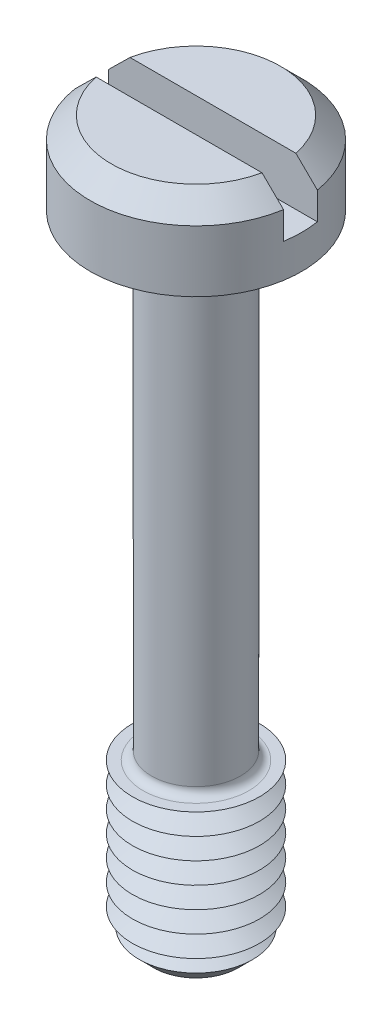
ISO-10303-21;
HEADER;
FILE_DESCRIPTION(('STEP AP214'),'2;1');
FILE_NAME('part.step','',(''),(''),'','','');
FILE_SCHEMA(('AUTOMOTIVE_DESIGN { 1 0 10303 214 1 1 1 1 }'));
ENDSEC;
DATA;
#1=APPLICATION_CONTEXT('core data for automotive mechanical design processes');
#2=APPLICATION_PROTOCOL_DEFINITION('international standard','automotive_design',2000,#1);
#3=PRODUCT_CONTEXT('',#1,'mechanical');
#4=PRODUCT('Part','Part','',(#3));
#5=PRODUCT_RELATED_PRODUCT_CATEGORY('part','',(#4));
#6=PRODUCT_DEFINITION_FORMATION('','',#4);
#7=PRODUCT_DEFINITION_CONTEXT('part definition',#1,'design');
#8=PRODUCT_DEFINITION('design','',#6,#7);
#9=PRODUCT_DEFINITION_SHAPE('','',#8);
#10=(LENGTH_UNIT() NAMED_UNIT(*) SI_UNIT(.MILLI.,.METRE.));
#11=(NAMED_UNIT(*) PLANE_ANGLE_UNIT() SI_UNIT($,.RADIAN.));
#12=(NAMED_UNIT(*) SI_UNIT($,.STERADIAN.) SOLID_ANGLE_UNIT());
#13=UNCERTAINTY_MEASURE_WITH_UNIT(LENGTH_MEASURE(1.E-05),#10,'distance_accuracy_value','');
#14=(GEOMETRIC_REPRESENTATION_CONTEXT(3) GLOBAL_UNCERTAINTY_ASSIGNED_CONTEXT((#13)) GLOBAL_UNIT_ASSIGNED_CONTEXT((#10,
#11,#12)) REPRESENTATION_CONTEXT('',''));
#15=CARTESIAN_POINT('',(0.,0.,0.));
#16=DIRECTION('',(0.,0.,1.));
#17=DIRECTION('',(1.,0.,0.));
#18=AXIS2_PLACEMENT_3D('',#15,#16,#17);
#19=CARTESIAN_POINT('',(0.,3.9,0.));
#20=DIRECTION('',(0.,1.,0.));
#21=DIRECTION('',(0.,0.,1.));
#22=AXIS2_PLACEMENT_3D('',#19,#20,#21);
#23=PLANE('',#22);
#24=DIRECTION('',(-1.,0.,0.));
#25=VECTOR('',#24,1.);
#26=CARTESIAN_POINT('',(5.,3.9,-0.8));
#27=LINE('',#26,#25);
#28=CARTESIAN_POINT('',(3.91918358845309,3.9,-0.8));
#29=VERTEX_POINT('',#28);
#30=CARTESIAN_POINT('',(-3.91918358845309,3.9,-0.8));
#31=VERTEX_POINT('',#30);
#32=EDGE_CURVE('E110',#29,#31,#27,.T.);
#33=ORIENTED_EDGE('',*,*,#32,.F.);
#34=CARTESIAN_POINT('',(0.,3.9,0.));
#35=DIRECTION('',(0.,1.,0.));
#36=DIRECTION('',(0.,0.,1.));
#37=AXIS2_PLACEMENT_3D('',#34,#35,#36);
#38=CIRCLE('',#37,4.);
#39=EDGE_CURVE('E113',#29,#31,#38,.T.);
#40=ORIENTED_EDGE('',*,*,#39,.T.);
#41=EDGE_LOOP('',(#33,#40));
#42=FACE_BOUND('',#41,.T.);
#43=ADVANCED_FACE('F39',(#42),#23,.T.);
#44=CARTESIAN_POINT('',(0.,3.9,0.));
#45=DIRECTION('',(0.,-1.,0.));
#46=DIRECTION('',(0.,0.,-1.));
#47=AXIS2_PLACEMENT_3D('',#44,#45,#46);
#48=CONICAL_SURFACE('',#47,4.,0.785398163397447);
#49=CARTESIAN_POINT('',(11.0010756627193,-3.13012537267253,-0.8));
#50=CARTESIAN_POINT('',(10.6180645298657,-2.74813121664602,-0.8));
#51=CARTESIAN_POINT('',(10.2350087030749,-2.36618183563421,-0.8));
#52=CARTESIAN_POINT('',(9.46873746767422,-1.60241986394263,-0.8));
#53=CARTESIAN_POINT('',(9.08552205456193,-1.2206072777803,-0.8));
#54=CARTESIAN_POINT('',(8.31861292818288,-0.456918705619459,-0.8));
#55=CARTESIAN_POINT('',(7.93491906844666,-0.0750428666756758,-0.8));
#56=CARTESIAN_POINT('',(7.16722555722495,0.688378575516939,-0.8));
#57=CARTESIAN_POINT('',(6.78322591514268,1.06992418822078,-0.8));
#58=CARTESIAN_POINT('',(6.01856215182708,1.82868912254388,-0.8));
#59=CARTESIAN_POINT('',(5.63790309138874,2.20591354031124,-0.8));
#60=CARTESIAN_POINT('',(5.06622054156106,2.77108317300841,-0.8));
#61=CARTESIAN_POINT('',(4.87553531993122,2.9593704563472,-0.8));
#62=CARTESIAN_POINT('',(4.49384424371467,3.33561647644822,-0.8));
#63=CARTESIAN_POINT('',(4.302838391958,3.52357521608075,-0.8));
#64=CARTESIAN_POINT('',(3.92044271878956,3.89893397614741,-0.8));
#65=CARTESIAN_POINT('',(3.72905310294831,4.08633420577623,-0.8));
#66=CARTESIAN_POINT('',(3.34554223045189,4.46039762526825,-0.8));
#67=CARTESIAN_POINT('',(3.15342094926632,4.64706078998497,-0.8));
#68=CARTESIAN_POINT('',(2.76802565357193,5.01913697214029,-0.8));
#69=CARTESIAN_POINT('',(2.57475182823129,5.20455018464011,-0.8));
#70=CARTESIAN_POINT('',(2.28318236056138,5.4809110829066,-0.8));
#71=CARTESIAN_POINT('',(2.1857187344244,5.57273577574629,-0.8));
#72=CARTESIAN_POINT('',(1.98998431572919,5.75552004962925,-0.8));
#73=CARTESIAN_POINT('',(1.89171354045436,5.84647964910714,-0.8));
#74=CARTESIAN_POINT('',(1.76578543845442,5.96147491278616,-0.8));
#75=CARTESIAN_POINT('',(1.73869031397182,5.98612635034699,-0.8));
#76=CARTESIAN_POINT('',(1.68439529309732,6.0353137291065,-0.8));
#77=CARTESIAN_POINT('',(1.65719539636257,6.05984966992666,-0.8));
#78=CARTESIAN_POINT('',(1.5754162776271,6.13326356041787,-0.8));
#79=CARTESIAN_POINT('',(1.52066027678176,6.18194515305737,-0.8));
#80=CARTESIAN_POINT('',(1.41038257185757,6.27874171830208,-0.8));
#81=CARTESIAN_POINT('',(1.35485918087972,6.32685477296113,-0.8));
#82=CARTESIAN_POINT('',(1.24299231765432,6.42210730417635,-0.8));
#83=CARTESIAN_POINT('',(1.18664895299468,6.46924690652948,-0.8));
#84=CARTESIAN_POINT('',(1.07845249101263,6.55754663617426,-0.8));
#85=CARTESIAN_POINT('',(1.02670624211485,6.59883713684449,-0.8));
#86=CARTESIAN_POINT('',(0.921961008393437,6.67979338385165,-0.8));
#87=CARTESIAN_POINT('',(0.868962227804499,6.7194593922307,-0.8));
#88=CARTESIAN_POINT('',(0.761295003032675,6.79630361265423,-0.8));
#89=CARTESIAN_POINT('',(0.706629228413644,6.83348552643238,-0.8));
#90=CARTESIAN_POINT('',(0.594896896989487,6.90399895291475,-0.8));
#91=CARTESIAN_POINT('',(0.5378333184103,6.93733506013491,-0.8));
#92=CARTESIAN_POINT('',(0.428390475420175,6.99356340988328,-0.8));
#93=CARTESIAN_POINT('',(0.376435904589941,7.0172602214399,-0.8));
#94=CARTESIAN_POINT('',(0.269759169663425,7.05717670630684,-0.8));
#95=CARTESIAN_POINT('',(0.215046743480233,7.07342088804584,-0.8));
#96=CARTESIAN_POINT('',(0.113016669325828,7.093321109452,-0.8));
#97=CARTESIAN_POINT('',(0.0660435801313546,7.09866042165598,-0.8));
#98=CARTESIAN_POINT('',(-0.0280587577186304,7.10088875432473,-0.8));
#99=CARTESIAN_POINT('',(-0.0751877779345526,7.09778705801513,-0.8));
#100=CARTESIAN_POINT('',(-0.180723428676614,7.08192474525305,-0.8));
#101=CARTESIAN_POINT('',(-0.238762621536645,7.066795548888,-0.8));
#102=CARTESIAN_POINT('',(-0.323499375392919,7.03748409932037,-0.8));
#103=CARTESIAN_POINT('',(-0.351441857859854,7.0265659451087,-0.8));
#104=CARTESIAN_POINT('',(-0.40656991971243,7.00295901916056,-0.8));
#105=CARTESIAN_POINT('',(-0.433755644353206,6.99027059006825,-0.8));
#106=CARTESIAN_POINT('',(-0.504673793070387,6.95489235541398,-0.8));
#107=CARTESIAN_POINT('',(-0.547808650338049,6.93101671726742,-0.8));
#108=CARTESIAN_POINT('',(-0.632566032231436,6.88069648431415,-0.8));
#109=CARTESIAN_POINT('',(-0.674187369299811,6.85424992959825,-0.8));
#110=CARTESIAN_POINT('',(-0.756326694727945,6.79950439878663,-0.8));
#111=CARTESIAN_POINT('',(-0.796841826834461,6.77120117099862,-0.8));
#112=CARTESIAN_POINT('',(-0.876938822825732,6.71329852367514,-0.8));
#113=CARTESIAN_POINT('',(-0.916520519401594,6.68369887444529,-0.8));
#114=CARTESIAN_POINT('',(-1.03465904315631,6.59312324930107,-0.8));
#115=CARTESIAN_POINT('',(-1.11211338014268,6.5307142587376,-0.8));
#116=CARTESIAN_POINT('',(-1.26505454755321,6.40381418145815,-0.8));
#117=CARTESIAN_POINT('',(-1.34054439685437,6.33932667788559,-0.8));
#118=CARTESIAN_POINT('',(-1.48913173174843,6.2099708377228,-0.8));
#119=CARTESIAN_POINT('',(-1.5622481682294,6.14512422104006,-0.8));
#120=CARTESIAN_POINT('',(-1.70765393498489,6.01451044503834,-0.8));
#121=CARTESIAN_POINT('',(-1.77994324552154,5.94874326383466,-0.8));
#122=CARTESIAN_POINT('',(-1.99594639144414,5.75046596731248,-0.8));
#123=CARTESIAN_POINT('',(-2.13877767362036,5.61699583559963,-0.8));
#124=CARTESIAN_POINT('',(-2.42324632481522,5.34853800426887,-0.8));
#125=CARTESIAN_POINT('',(-2.56488247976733,5.21354902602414,-0.8));
#126=CARTESIAN_POINT('',(-2.84730929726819,4.94270932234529,-0.8));
#127=CARTESIAN_POINT('',(-2.98810001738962,4.80685865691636,-0.8));
#128=CARTESIAN_POINT('',(-3.26818763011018,4.53549974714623,-0.8));
#129=CARTESIAN_POINT('',(-3.40748821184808,4.39999530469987,-0.8));
#130=CARTESIAN_POINT('',(-3.68570899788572,4.12859172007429,-0.8));
#131=CARTESIAN_POINT('',(-3.82462919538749,3.99269257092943,-0.8));
#132=CARTESIAN_POINT('',(-4.24087543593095,3.58468153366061,-0.8));
#133=CARTESIAN_POINT('',(-4.51779300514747,3.31215310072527,-0.8));
#134=CARTESIAN_POINT('',(-5.05279381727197,2.78443938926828,-0.8));
#135=CARTESIAN_POINT('',(-5.31091639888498,2.52929393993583,-0.8));
#136=CARTESIAN_POINT('',(-5.82680751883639,2.01864429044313,-0.8));
#137=CARTESIAN_POINT('',(-6.08457605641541,1.76314008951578,-0.8));
#138=CARTESIAN_POINT('',(-6.85760508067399,0.99619419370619,-0.8));
#139=CARTESIAN_POINT('',(-7.37251152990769,0.484395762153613,-0.8));
#140=CARTESIAN_POINT('',(-8.40657233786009,-0.544392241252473,-0.8));
#141=CARTESIAN_POINT('',(-8.92572224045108,-1.06138628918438,-0.8));
#142=CARTESIAN_POINT('',(-9.9636287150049,-2.09560660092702,-0.8));
#143=CARTESIAN_POINT('',(-10.4823853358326,-2.61283281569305,-0.8));
#144=CARTESIAN_POINT('',(-11.0010756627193,-3.13012537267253,-0.8));
#145=B_SPLINE_CURVE_WITH_KNOTS('',3,(#49,#50,#51,#52,#53,#54,#55,#56,#57,#58,#59,#60,#61,#62,
#63,#64,#65,#66,#67,#68,#69,#70,#71,#72,#73,#74,#75,#76,#77,#78,#79,#80,#81,#82,#83,#84,#85,#86,
#87,#88,#89,#90,#91,#92,#93,#94,#95,#96,#97,#98,#99,#100,#101,#102,#103,#104,#105,#106,#107,
#108,#109,#110,#111,#112,#113,#114,#115,#116,#117,#118,#119,#120,#121,#122,#123,#124,#125,#126,
#127,#128,#129,#130,#131,#132,#133,#134,#135,#136,#137,#138,#139,#140,#141,#142,#143,#144),
.UNSPECIFIED.,.F.,.F.,(4,2,2,2,2,2,2,2,2,2,2,2,2,2,2,2,2,2,2,2,2,2,2,2,2,2,2,2,2,2,2,2,2,2,2,2,
2,2,2,2,2,2,2,2,2,2,2,4),(0.,1.62282275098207,3.24569489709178,4.86971791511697,
6.49369278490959,8.10142191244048,8.90535980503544,9.7092906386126,10.5128682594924,
11.3164730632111,12.1199494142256,12.5216659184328,12.9233738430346,13.0332669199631,
13.1431603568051,13.3629580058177,13.5833578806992,13.8037290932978,14.0023112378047,
14.2008612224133,14.3991084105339,14.5971162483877,14.7680800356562,14.9384774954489,
15.0795987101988,15.2205647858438,15.3993585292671,15.4893211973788,15.5792664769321,
15.727032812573,15.8749126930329,16.0231439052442,16.1714014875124,16.4697244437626,
16.767558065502,17.0607348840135,17.35391868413,17.9403574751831,18.5273336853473,
19.1142694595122,19.6972736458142,20.2802881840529,21.4458742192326,22.5346981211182,
23.6235243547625,25.8015035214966,27.9995014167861,30.1971550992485),.UNSPECIFIED.);
#146=CARTESIAN_POINT('',(4.93558507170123,2.9,-0.8));
#147=VERTEX_POINT('',#146);
#148=EDGE_CURVE('E252',#147,#29,#145,.T.);
#149=ORIENTED_EDGE('',*,*,#148,.F.);
#150=CARTESIAN_POINT('',(0.,2.9,0.));
#151=DIRECTION('',(0.,1.,0.));
#152=DIRECTION('',(0.,0.,1.));
#153=AXIS2_PLACEMENT_3D('',#150,#151,#152);
#154=CIRCLE('',#153,5.);
#155=CARTESIAN_POINT('',(-4.93558507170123,2.9,-0.8));
#156=VERTEX_POINT('',#155);
#157=EDGE_CURVE('E128',#156,#147,#154,.F.);
#158=ORIENTED_EDGE('',*,*,#157,.F.);
#159=EDGE_CURVE('E102',#31,#156,#145,.T.);
#160=ORIENTED_EDGE('',*,*,#159,.F.);
#161=ORIENTED_EDGE('',*,*,#39,.F.);
#162=EDGE_LOOP('',(#149,#158,#160,#161));
#163=FACE_BOUND('',#162,.T.);
#164=ADVANCED_FACE('F214',(#163),#48,.T.);
#165=CARTESIAN_POINT('',(0.,-30.,0.));
#166=DIRECTION('',(0.,1.,0.));
#167=DIRECTION('',(0.,0.,1.));
#168=AXIS2_PLACEMENT_3D('',#165,#166,#167);
#169=CYLINDRICAL_SURFACE('',#168,2.1);
#170=CARTESIAN_POINT('',(0.,-22.1,0.));
#171=DIRECTION('',(0.,-1.,0.));
#172=DIRECTION('',(0.,0.,-1.));
#173=AXIS2_PLACEMENT_3D('',#170,#171,#172);
#174=CIRCLE('',#173,2.1);
#175=CARTESIAN_POINT('',(0.,-22.1,-2.1));
#176=VERTEX_POINT('',#175);
#177=EDGE_CURVE('E123',#176,#176,#174,.F.);
#178=ORIENTED_EDGE('',*,*,#177,.T.);
#179=EDGE_LOOP('',(#178));
#180=FACE_BOUND('',#179,.T.);
#181=CARTESIAN_POINT('',(0.,-0.400000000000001,0.));
#182=DIRECTION('',(0.,1.,0.));
#183=DIRECTION('',(0.,0.,1.));
#184=AXIS2_PLACEMENT_3D('',#181,#182,#183);
#185=CIRCLE('',#184,2.1);
#186=CARTESIAN_POINT('',(0.,-0.400000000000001,2.1));
#187=VERTEX_POINT('',#186);
#188=EDGE_CURVE('E349',#187,#187,#185,.F.);
#189=ORIENTED_EDGE('',*,*,#188,.T.);
#190=EDGE_LOOP('',(#189));
#191=FACE_BOUND('',#190,.T.);
#192=ADVANCED_FACE('F210',(#180,#191),#169,.T.);
#193=CARTESIAN_POINT('',(0.,3.9,0.));
#194=DIRECTION('',(0.,-1.,0.));
#195=DIRECTION('',(0.,0.,-1.));
#196=AXIS2_PLACEMENT_3D('',#193,#194,#195);
#197=CYLINDRICAL_SURFACE('',#196,5.);
#198=ORIENTED_EDGE('',*,*,#157,.T.);
#199=DIRECTION('',(0.,-1.,0.));
#200=VECTOR('',#199,1.);
#201=CARTESIAN_POINT('',(4.93558507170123,3.9,-0.8));
#202=LINE('',#201,#200);
#203=CARTESIAN_POINT('',(4.93558507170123,1.6,-0.8));
#204=VERTEX_POINT('',#203);
#205=EDGE_CURVE('E64',#147,#204,#202,.T.);
#206=ORIENTED_EDGE('',*,*,#205,.T.);
#207=CARTESIAN_POINT('',(0.,1.6,0.));
#208=DIRECTION('',(0.,1.,0.));
#209=DIRECTION('',(0.,0.,1.));
#210=AXIS2_PLACEMENT_3D('',#207,#208,#209);
#211=CIRCLE('',#210,5.);
#212=CARTESIAN_POINT('',(4.93558507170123,1.6,0.8));
#213=VERTEX_POINT('',#212);
#214=EDGE_CURVE('E11',#213,#204,#211,.T.);
#215=ORIENTED_EDGE('',*,*,#214,.F.);
#216=DIRECTION('',(0.,-1.,0.));
#217=VECTOR('',#216,1.);
#218=CARTESIAN_POINT('',(4.93558507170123,3.9,0.8));
#219=LINE('',#218,#217);
#220=CARTESIAN_POINT('',(4.93558507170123,2.9,0.8));
#221=VERTEX_POINT('',#220);
#222=EDGE_CURVE('E268',#213,#221,#219,.F.);
#223=ORIENTED_EDGE('',*,*,#222,.T.);
#224=CARTESIAN_POINT('',(-4.93558507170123,2.9,0.8));
#225=VERTEX_POINT('',#224);
#226=EDGE_CURVE('E120',#221,#225,#154,.F.);
#227=ORIENTED_EDGE('',*,*,#226,.T.);
#228=DIRECTION('',(0.,-1.,0.));
#229=VECTOR('',#228,1.);
#230=CARTESIAN_POINT('',(-4.93558507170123,3.9,0.8));
#231=LINE('',#230,#229);
#232=CARTESIAN_POINT('',(-4.93558507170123,1.6,0.8));
#233=VERTEX_POINT('',#232);
#234=EDGE_CURVE('E96',#225,#233,#231,.T.);
#235=ORIENTED_EDGE('',*,*,#234,.T.);
#236=CARTESIAN_POINT('',(-4.93558507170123,1.6,-0.8));
#237=VERTEX_POINT('',#236);
#238=EDGE_CURVE('E44',#237,#233,#211,.T.);
#239=ORIENTED_EDGE('',*,*,#238,.F.);
#240=DIRECTION('',(0.,-1.,0.));
#241=VECTOR('',#240,1.);
#242=CARTESIAN_POINT('',(-4.93558507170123,3.9,-0.8));
#243=LINE('',#242,#241);
#244=EDGE_CURVE('E272',#237,#156,#243,.F.);
#245=ORIENTED_EDGE('',*,*,#244,.T.);
#246=EDGE_LOOP('',(#198,#206,#215,#223,#227,#235,#239,#245));
#247=FACE_BOUND('',#246,.T.);
#248=CARTESIAN_POINT('',(0.,0.,0.));
#249=DIRECTION('',(0.,1.,0.));
#250=DIRECTION('',(0.,0.,1.));
#251=AXIS2_PLACEMENT_3D('',#248,#249,#250);
#252=CIRCLE('',#251,5.);
#253=CARTESIAN_POINT('',(0.,0.,5.));
#254=VERTEX_POINT('',#253);
#255=EDGE_CURVE('E334',#254,#254,#252,.T.);
#256=ORIENTED_EDGE('',*,*,#255,.T.);
#257=EDGE_LOOP('',(#256));
#258=FACE_BOUND('',#257,.T.);
#259=ADVANCED_FACE('F213',(#247,#258),#197,.T.);
#260=DIRECTION('',(1.,0.,0.));
#261=VECTOR('',#260,1.);
#262=CARTESIAN_POINT('',(5.,3.9,0.8));
#263=LINE('',#262,#261);
#264=CARTESIAN_POINT('',(-3.91918358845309,3.9,0.8));
#265=VERTEX_POINT('',#264);
#266=CARTESIAN_POINT('',(3.91918358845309,3.9,0.8));
#267=VERTEX_POINT('',#266);
#268=EDGE_CURVE('E56',#265,#267,#263,.T.);
#269=ORIENTED_EDGE('',*,*,#268,.F.);
#270=EDGE_CURVE('E108',#265,#267,#38,.T.);
#271=ORIENTED_EDGE('',*,*,#270,.T.);
#272=EDGE_LOOP('',(#269,#271));
#273=FACE_BOUND('',#272,.T.);
#274=ADVANCED_FACE('F107',(#273),#23,.T.);
#275=CARTESIAN_POINT('',(0.,0.,0.));
#276=DIRECTION('',(0.,1.,0.));
#277=DIRECTION('',(0.,0.,1.));
#278=AXIS2_PLACEMENT_3D('',#275,#276,#277);
#279=PLANE('',#278);
#280=CARTESIAN_POINT('',(0.,0.,0.));
#281=DIRECTION('',(0.,1.,0.));
#282=DIRECTION('',(0.,0.,1.));
#283=AXIS2_PLACEMENT_3D('',#280,#281,#282);
#284=CIRCLE('',#283,2.5);
#285=CARTESIAN_POINT('',(0.,0.,2.5));
#286=VERTEX_POINT('',#285);
#287=EDGE_CURVE('E114',#286,#286,#284,.T.);
#288=ORIENTED_EDGE('',*,*,#287,.T.);
#289=EDGE_LOOP('',(#288));
#290=FACE_BOUND('',#289,.T.);
#291=ORIENTED_EDGE('',*,*,#255,.F.);
#292=EDGE_LOOP('',(#291));
#293=FACE_BOUND('',#292,.T.);
#294=ADVANCED_FACE('F204',(#290,#293),#279,.F.);
#295=CARTESIAN_POINT('',(0.,-22.5,0.));
#296=DIRECTION('',(0.,-1.,0.));
#297=DIRECTION('',(0.,0.,-1.));
#298=AXIS2_PLACEMENT_3D('',#295,#296,#297);
#299=PLANE('',#298);
#300=CARTESIAN_POINT('',(0.,-22.5,0.));
#301=DIRECTION('',(0.,-1.,0.));
#302=DIRECTION('',(0.,0.,-1.));
#303=AXIS2_PLACEMENT_3D('',#300,#301,#302);
#304=CIRCLE('',#303,2.5);
#305=CARTESIAN_POINT('',(0.,-22.5,-2.5));
#306=VERTEX_POINT('',#305);
#307=EDGE_CURVE('E342',#306,#306,#304,.T.);
#308=ORIENTED_EDGE('',*,*,#307,.T.);
#309=EDGE_LOOP('',(#308));
#310=FACE_BOUND('',#309,.T.);
#311=CARTESIAN_POINT('',(0.,-22.5,0.));
#312=DIRECTION('',(0.,1.,0.));
#313=DIRECTION('',(0.,0.,1.));
#314=AXIS2_PLACEMENT_3D('',#311,#312,#313);
#315=CIRCLE('',#314,3.);
#316=CARTESIAN_POINT('',(0.,-22.5,3.));
#317=VERTEX_POINT('',#316);
#318=EDGE_CURVE('E331',#317,#317,#315,.T.);
#319=ORIENTED_EDGE('',*,*,#318,.T.);
#320=EDGE_LOOP('',(#319));
#321=FACE_BOUND('',#320,.T.);
#322=ADVANCED_FACE('F200',(#310,#321),#299,.F.);
#323=CARTESIAN_POINT('',(0.,-23.,0.));
#324=DIRECTION('',(0.,1.,0.));
#325=DIRECTION('',(0.,0.,1.));
#326=AXIS2_PLACEMENT_3D('',#323,#324,#325);
#327=CONICAL_SURFACE('',#326,2.13397459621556,1.0471975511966);
#328=ORIENTED_EDGE('',*,*,#318,.F.);
#329=EDGE_LOOP('',(#328));
#330=FACE_BOUND('',#329,.T.);
#331=CARTESIAN_POINT('',(0.,-23.,0.));
#332=DIRECTION('',(0.,1.,0.));
#333=DIRECTION('',(0.,0.,1.));
#334=AXIS2_PLACEMENT_3D('',#331,#332,#333);
#335=CIRCLE('',#334,2.13397459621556);
#336=CARTESIAN_POINT('',(0.,-23.,2.13397459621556));
#337=VERTEX_POINT('',#336);
#338=EDGE_CURVE('E327',#337,#337,#335,.T.);
#339=ORIENTED_EDGE('',*,*,#338,.T.);
#340=EDGE_LOOP('',(#339));
#341=FACE_BOUND('',#340,.T.);
#342=ADVANCED_FACE('F196',(#330,#341),#327,.T.);
#343=CARTESIAN_POINT('',(0.,-23.5,0.));
#344=DIRECTION('',(0.,-1.,0.));
#345=DIRECTION('',(0.,0.,-1.));
#346=AXIS2_PLACEMENT_3D('',#343,#344,#345);
#347=CONICAL_SURFACE('',#346,3.,1.0471975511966);
#348=ORIENTED_EDGE('',*,*,#338,.F.);
#349=EDGE_LOOP('',(#348));
#350=FACE_BOUND('',#349,.T.);
#351=CARTESIAN_POINT('',(0.,-23.5,0.));
#352=DIRECTION('',(0.,1.,0.));
#353=DIRECTION('',(0.,0.,1.));
#354=AXIS2_PLACEMENT_3D('',#351,#352,#353);
#355=CIRCLE('',#354,3.);
#356=CARTESIAN_POINT('',(0.,-23.5,3.));
#357=VERTEX_POINT('',#356);
#358=EDGE_CURVE('E323',#357,#357,#355,.T.);
#359=ORIENTED_EDGE('',*,*,#358,.T.);
#360=EDGE_LOOP('',(#359));
#361=FACE_BOUND('',#360,.T.);
#362=ADVANCED_FACE('F192',(#350,#361),#347,.T.);
#363=CARTESIAN_POINT('',(0.,-24.,0.));
#364=DIRECTION('',(0.,1.,0.));
#365=DIRECTION('',(0.,0.,1.));
#366=AXIS2_PLACEMENT_3D('',#363,#364,#365);
#367=CONICAL_SURFACE('',#366,2.13397459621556,1.0471975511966);
#368=ORIENTED_EDGE('',*,*,#358,.F.);
#369=EDGE_LOOP('',(#368));
#370=FACE_BOUND('',#369,.T.);
#371=CARTESIAN_POINT('',(0.,-24.,0.));
#372=DIRECTION('',(0.,1.,0.));
#373=DIRECTION('',(0.,0.,1.));
#374=AXIS2_PLACEMENT_3D('',#371,#372,#373);
#375=CIRCLE('',#374,2.13397459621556);
#376=CARTESIAN_POINT('',(0.,-24.,2.13397459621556));
#377=VERTEX_POINT('',#376);
#378=EDGE_CURVE('E319',#377,#377,#375,.T.);
#379=ORIENTED_EDGE('',*,*,#378,.T.);
#380=EDGE_LOOP('',(#379));
#381=FACE_BOUND('',#380,.T.);
#382=ADVANCED_FACE('F188',(#370,#381),#367,.T.);
#383=CARTESIAN_POINT('',(0.,-24.5,0.));
#384=DIRECTION('',(0.,-1.,0.));
#385=DIRECTION('',(0.,0.,-1.));
#386=AXIS2_PLACEMENT_3D('',#383,#384,#385);
#387=CONICAL_SURFACE('',#386,3.,1.0471975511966);
#388=ORIENTED_EDGE('',*,*,#378,.F.);
#389=EDGE_LOOP('',(#388));
#390=FACE_BOUND('',#389,.T.);
#391=CARTESIAN_POINT('',(0.,-24.5,0.));
#392=DIRECTION('',(0.,1.,0.));
#393=DIRECTION('',(0.,0.,1.));
#394=AXIS2_PLACEMENT_3D('',#391,#392,#393);
#395=CIRCLE('',#394,3.);
#396=CARTESIAN_POINT('',(0.,-24.5,3.));
#397=VERTEX_POINT('',#396);
#398=EDGE_CURVE('E315',#397,#397,#395,.T.);
#399=ORIENTED_EDGE('',*,*,#398,.T.);
#400=EDGE_LOOP('',(#399));
#401=FACE_BOUND('',#400,.T.);
#402=ADVANCED_FACE('F184',(#390,#401),#387,.T.);
#403=CARTESIAN_POINT('',(0.,-25.,0.));
#404=DIRECTION('',(0.,1.,0.));
#405=DIRECTION('',(0.,0.,1.));
#406=AXIS2_PLACEMENT_3D('',#403,#404,#405);
#407=CONICAL_SURFACE('',#406,2.13397459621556,1.0471975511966);
#408=ORIENTED_EDGE('',*,*,#398,.F.);
#409=EDGE_LOOP('',(#408));
#410=FACE_BOUND('',#409,.T.);
#411=CARTESIAN_POINT('',(0.,-25.,0.));
#412=DIRECTION('',(0.,1.,0.));
#413=DIRECTION('',(0.,0.,1.));
#414=AXIS2_PLACEMENT_3D('',#411,#412,#413);
#415=CIRCLE('',#414,2.13397459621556);
#416=CARTESIAN_POINT('',(0.,-25.,2.13397459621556));
#417=VERTEX_POINT('',#416);
#418=EDGE_CURVE('E311',#417,#417,#415,.T.);
#419=ORIENTED_EDGE('',*,*,#418,.T.);
#420=EDGE_LOOP('',(#419));
#421=FACE_BOUND('',#420,.T.);
#422=ADVANCED_FACE('F180',(#410,#421),#407,.T.);
#423=CARTESIAN_POINT('',(0.,-25.5,0.));
#424=DIRECTION('',(0.,-1.,0.));
#425=DIRECTION('',(0.,0.,-1.));
#426=AXIS2_PLACEMENT_3D('',#423,#424,#425);
#427=CONICAL_SURFACE('',#426,3.,1.0471975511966);
#428=ORIENTED_EDGE('',*,*,#418,.F.);
#429=EDGE_LOOP('',(#428));
#430=FACE_BOUND('',#429,.T.);
#431=CARTESIAN_POINT('',(0.,-25.5,0.));
#432=DIRECTION('',(0.,1.,0.));
#433=DIRECTION('',(0.,0.,1.));
#434=AXIS2_PLACEMENT_3D('',#431,#432,#433);
#435=CIRCLE('',#434,3.);
#436=CARTESIAN_POINT('',(0.,-25.5,3.));
#437=VERTEX_POINT('',#436);
#438=EDGE_CURVE('E307',#437,#437,#435,.T.);
#439=ORIENTED_EDGE('',*,*,#438,.T.);
#440=EDGE_LOOP('',(#439));
#441=FACE_BOUND('',#440,.T.);
#442=ADVANCED_FACE('F176',(#430,#441),#427,.T.);
#443=CARTESIAN_POINT('',(0.,-26.,0.));
#444=DIRECTION('',(0.,1.,0.));
#445=DIRECTION('',(0.,0.,1.));
#446=AXIS2_PLACEMENT_3D('',#443,#444,#445);
#447=CONICAL_SURFACE('',#446,2.13397459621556,1.0471975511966);
#448=ORIENTED_EDGE('',*,*,#438,.F.);
#449=EDGE_LOOP('',(#448));
#450=FACE_BOUND('',#449,.T.);
#451=CARTESIAN_POINT('',(0.,-26.,0.));
#452=DIRECTION('',(0.,1.,0.));
#453=DIRECTION('',(0.,0.,1.));
#454=AXIS2_PLACEMENT_3D('',#451,#452,#453);
#455=CIRCLE('',#454,2.13397459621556);
#456=CARTESIAN_POINT('',(0.,-26.,2.13397459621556));
#457=VERTEX_POINT('',#456);
#458=EDGE_CURVE('E303',#457,#457,#455,.T.);
#459=ORIENTED_EDGE('',*,*,#458,.T.);
#460=EDGE_LOOP('',(#459));
#461=FACE_BOUND('',#460,.T.);
#462=ADVANCED_FACE('F172',(#450,#461),#447,.T.);
#463=CARTESIAN_POINT('',(0.,-26.5,0.));
#464=DIRECTION('',(0.,-1.,0.));
#465=DIRECTION('',(0.,0.,-1.));
#466=AXIS2_PLACEMENT_3D('',#463,#464,#465);
#467=CONICAL_SURFACE('',#466,3.,1.0471975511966);
#468=ORIENTED_EDGE('',*,*,#458,.F.);
#469=EDGE_LOOP('',(#468));
#470=FACE_BOUND('',#469,.T.);
#471=CARTESIAN_POINT('',(0.,-26.5,0.));
#472=DIRECTION('',(0.,1.,0.));
#473=DIRECTION('',(0.,0.,1.));
#474=AXIS2_PLACEMENT_3D('',#471,#472,#473);
#475=CIRCLE('',#474,3.);
#476=CARTESIAN_POINT('',(0.,-26.5,3.));
#477=VERTEX_POINT('',#476);
#478=EDGE_CURVE('E299',#477,#477,#475,.T.);
#479=ORIENTED_EDGE('',*,*,#478,.T.);
#480=EDGE_LOOP('',(#479));
#481=FACE_BOUND('',#480,.T.);
#482=ADVANCED_FACE('F168',(#470,#481),#467,.T.);
#483=CARTESIAN_POINT('',(0.,-27.,0.));
#484=DIRECTION('',(0.,1.,0.));
#485=DIRECTION('',(0.,0.,1.));
#486=AXIS2_PLACEMENT_3D('',#483,#484,#485);
#487=CONICAL_SURFACE('',#486,2.13397459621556,1.0471975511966);
#488=ORIENTED_EDGE('',*,*,#478,.F.);
#489=EDGE_LOOP('',(#488));
#490=FACE_BOUND('',#489,.T.);
#491=CARTESIAN_POINT('',(0.,-27.,0.));
#492=DIRECTION('',(0.,1.,0.));
#493=DIRECTION('',(0.,0.,1.));
#494=AXIS2_PLACEMENT_3D('',#491,#492,#493);
#495=CIRCLE('',#494,2.13397459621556);
#496=CARTESIAN_POINT('',(0.,-27.,2.13397459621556));
#497=VERTEX_POINT('',#496);
#498=EDGE_CURVE('E295',#497,#497,#495,.T.);
#499=ORIENTED_EDGE('',*,*,#498,.T.);
#500=EDGE_LOOP('',(#499));
#501=FACE_BOUND('',#500,.T.);
#502=ADVANCED_FACE('F164',(#490,#501),#487,.T.);
#503=CARTESIAN_POINT('',(0.,-27.5,0.));
#504=DIRECTION('',(0.,-1.,0.));
#505=DIRECTION('',(0.,0.,-1.));
#506=AXIS2_PLACEMENT_3D('',#503,#504,#505);
#507=CONICAL_SURFACE('',#506,3.,1.0471975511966);
#508=ORIENTED_EDGE('',*,*,#498,.F.);
#509=EDGE_LOOP('',(#508));
#510=FACE_BOUND('',#509,.T.);
#511=CARTESIAN_POINT('',(0.,-27.5,0.));
#512=DIRECTION('',(0.,1.,0.));
#513=DIRECTION('',(0.,0.,1.));
#514=AXIS2_PLACEMENT_3D('',#511,#512,#513);
#515=CIRCLE('',#514,3.);
#516=CARTESIAN_POINT('',(0.,-27.5,3.));
#517=VERTEX_POINT('',#516);
#518=EDGE_CURVE('E291',#517,#517,#515,.T.);
#519=ORIENTED_EDGE('',*,*,#518,.T.);
#520=EDGE_LOOP('',(#519));
#521=FACE_BOUND('',#520,.T.);
#522=ADVANCED_FACE('F160',(#510,#521),#507,.T.);
#523=CARTESIAN_POINT('',(0.,-28.,0.));
#524=DIRECTION('',(0.,1.,0.));
#525=DIRECTION('',(0.,0.,1.));
#526=AXIS2_PLACEMENT_3D('',#523,#524,#525);
#527=CONICAL_SURFACE('',#526,2.13397459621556,1.0471975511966);
#528=ORIENTED_EDGE('',*,*,#518,.F.);
#529=EDGE_LOOP('',(#528));
#530=FACE_BOUND('',#529,.T.);
#531=CARTESIAN_POINT('',(0.,-28.,0.));
#532=DIRECTION('',(0.,1.,0.));
#533=DIRECTION('',(0.,0.,1.));
#534=AXIS2_PLACEMENT_3D('',#531,#532,#533);
#535=CIRCLE('',#534,2.13397459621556);
#536=CARTESIAN_POINT('',(0.,-28.,2.13397459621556));
#537=VERTEX_POINT('',#536);
#538=EDGE_CURVE('E288',#537,#537,#535,.T.);
#539=ORIENTED_EDGE('',*,*,#538,.T.);
#540=EDGE_LOOP('',(#539));
#541=FACE_BOUND('',#540,.T.);
#542=ADVANCED_FACE('F156',(#530,#541),#527,.T.);
#543=CARTESIAN_POINT('',(0.,-28.5,0.));
#544=DIRECTION('',(0.,-1.,0.));
#545=DIRECTION('',(0.,0.,-1.));
#546=AXIS2_PLACEMENT_3D('',#543,#544,#545);
#547=CONICAL_SURFACE('',#546,3.,1.0471975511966);
#548=ORIENTED_EDGE('',*,*,#538,.F.);
#549=EDGE_LOOP('',(#548));
#550=FACE_BOUND('',#549,.T.);
#551=CARTESIAN_POINT('',(0.,-28.5,0.));
#552=DIRECTION('',(0.,1.,0.));
#553=DIRECTION('',(0.,0.,1.));
#554=AXIS2_PLACEMENT_3D('',#551,#552,#553);
#555=CIRCLE('',#554,3.);
#556=CARTESIAN_POINT('',(0.,-28.5,3.));
#557=VERTEX_POINT('',#556);
#558=EDGE_CURVE('E283',#557,#557,#555,.T.);
#559=ORIENTED_EDGE('',*,*,#558,.T.);
#560=EDGE_LOOP('',(#559));
#561=FACE_BOUND('',#560,.T.);
#562=ADVANCED_FACE('F152',(#550,#561),#547,.T.);
#563=CARTESIAN_POINT('',(0.,-29.,0.));
#564=DIRECTION('',(0.,1.,0.));
#565=DIRECTION('',(0.,0.,1.));
#566=AXIS2_PLACEMENT_3D('',#563,#564,#565);
#567=CONICAL_SURFACE('',#566,2.13397459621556,1.0471975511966);
#568=ORIENTED_EDGE('',*,*,#558,.F.);
#569=EDGE_LOOP('',(#568));
#570=FACE_BOUND('',#569,.T.);
#571=CARTESIAN_POINT('',(0.,-29.,0.));
#572=DIRECTION('',(0.,1.,0.));
#573=DIRECTION('',(0.,0.,1.));
#574=AXIS2_PLACEMENT_3D('',#571,#572,#573);
#575=CIRCLE('',#574,2.13397459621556);
#576=CARTESIAN_POINT('',(0.,-29.,2.13397459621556));
#577=VERTEX_POINT('',#576);
#578=EDGE_CURVE('E280',#577,#577,#575,.T.);
#579=ORIENTED_EDGE('',*,*,#578,.T.);
#580=EDGE_LOOP('',(#579));
#581=FACE_BOUND('',#580,.T.);
#582=ADVANCED_FACE('F148',(#570,#581),#567,.T.);
#583=CARTESIAN_POINT('',(0.,-29.5,0.));
#584=DIRECTION('',(0.,-1.,0.));
#585=DIRECTION('',(0.,0.,-1.));
#586=AXIS2_PLACEMENT_3D('',#583,#584,#585);
#587=CONICAL_SURFACE('',#586,3.,1.0471975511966);
#588=CARTESIAN_POINT('',(0.,-29.3169872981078,0.));
#589=DIRECTION('',(0.,-1.,0.));
#590=DIRECTION('',(0.,0.,-1.));
#591=AXIS2_PLACEMENT_3D('',#588,#589,#590);
#592=CIRCLE('',#591,2.68301270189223);
#593=CARTESIAN_POINT('',(0.,-29.3169872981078,-2.68301270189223));
#594=VERTEX_POINT('',#593);
#595=EDGE_CURVE('E287',#594,#594,#592,.F.);
#596=ORIENTED_EDGE('',*,*,#595,.T.);
#597=EDGE_LOOP('',(#596));
#598=FACE_BOUND('',#597,.T.);
#599=ORIENTED_EDGE('',*,*,#578,.F.);
#600=EDGE_LOOP('',(#599));
#601=FACE_BOUND('',#600,.T.);
#602=ADVANCED_FACE('F144',(#598,#601),#587,.T.);
#603=CARTESIAN_POINT('',(0.,-30.,0.));
#604=DIRECTION('',(0.,-1.,0.));
#605=DIRECTION('',(0.,0.,-1.));
#606=AXIS2_PLACEMENT_3D('',#603,#604,#605);
#607=PLANE('',#606);
#608=CARTESIAN_POINT('',(0.,-30.,0.));
#609=DIRECTION('',(0.,-1.,0.));
#610=DIRECTION('',(0.,0.,-1.));
#611=AXIS2_PLACEMENT_3D('',#608,#609,#610);
#612=CIRCLE('',#611,2.00000000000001);
#613=CARTESIAN_POINT('',(0.,-30.,-2.00000000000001));
#614=VERTEX_POINT('',#613);
#615=EDGE_CURVE('E338',#614,#614,#612,.T.);
#616=ORIENTED_EDGE('',*,*,#615,.T.);
#617=EDGE_LOOP('',(#616));
#618=FACE_BOUND('',#617,.T.);
#619=ADVANCED_FACE('F147',(#618),#607,.T.);
#620=CARTESIAN_POINT('',(0.,-30.,0.));
#621=DIRECTION('',(0.,1.,0.));
#622=DIRECTION('',(0.,0.,1.));
#623=AXIS2_PLACEMENT_3D('',#620,#621,#622);
#624=CONICAL_SURFACE('',#623,2.00000000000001,0.785398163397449);
#625=ORIENTED_EDGE('',*,*,#595,.F.);
#626=EDGE_LOOP('',(#625));
#627=FACE_BOUND('',#626,.T.);
#628=ORIENTED_EDGE('',*,*,#615,.F.);
#629=EDGE_LOOP('',(#628));
#630=FACE_BOUND('',#629,.T.);
#631=ADVANCED_FACE('F208',(#627,#630),#624,.T.);
#632=CARTESIAN_POINT('',(0.,-22.1,0.));
#633=DIRECTION('',(0.,-1.,0.));
#634=DIRECTION('',(0.,0.,-1.));
#635=AXIS2_PLACEMENT_3D('',#632,#633,#634);
#636=TOROIDAL_SURFACE('',#635,2.5,0.4);
#637=ORIENTED_EDGE('',*,*,#177,.F.);
#638=EDGE_LOOP('',(#637));
#639=FACE_BOUND('',#638,.T.);
#640=ORIENTED_EDGE('',*,*,#307,.F.);
#641=EDGE_LOOP('',(#640));
#642=FACE_BOUND('',#641,.T.);
#643=ADVANCED_FACE('F226',(#639,#642),#636,.F.);
#644=CARTESIAN_POINT('',(0.,-0.400000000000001,0.));
#645=DIRECTION('',(0.,1.,0.));
#646=DIRECTION('',(0.,0.,1.));
#647=AXIS2_PLACEMENT_3D('',#644,#645,#646);
#648=TOROIDAL_SURFACE('',#647,2.5,0.4);
#649=ORIENTED_EDGE('',*,*,#287,.F.);
#650=EDGE_LOOP('',(#649));
#651=FACE_BOUND('',#650,.T.);
#652=ORIENTED_EDGE('',*,*,#188,.F.);
#653=EDGE_LOOP('',(#652));
#654=FACE_BOUND('',#653,.T.);
#655=ADVANCED_FACE('F229',(#651,#654),#648,.F.);
#656=CARTESIAN_POINT('',(-11.0010756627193,-3.13012537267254,0.8));
#657=CARTESIAN_POINT('',(-10.6180645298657,-2.74813121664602,0.8));
#658=CARTESIAN_POINT('',(-10.2350087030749,-2.36618183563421,0.8));
#659=CARTESIAN_POINT('',(-9.46873746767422,-1.60241986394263,0.8));
#660=CARTESIAN_POINT('',(-9.08552205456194,-1.2206072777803,0.8));
#661=CARTESIAN_POINT('',(-8.31861292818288,-0.456918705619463,0.8));
#662=CARTESIAN_POINT('',(-7.93491906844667,-0.0750428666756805,0.8));
#663=CARTESIAN_POINT('',(-7.16722555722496,0.688378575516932,0.8));
#664=CARTESIAN_POINT('',(-6.78322591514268,1.06992418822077,0.8));
#665=CARTESIAN_POINT('',(-6.01856215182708,1.82868912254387,0.8));
#666=CARTESIAN_POINT('',(-5.63790309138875,2.20591354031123,0.8));
#667=CARTESIAN_POINT('',(-5.06622054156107,2.7710831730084,0.8));
#668=CARTESIAN_POINT('',(-4.87553531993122,2.9593704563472,0.8));
#669=CARTESIAN_POINT('',(-4.49384424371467,3.33561647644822,0.8));
#670=CARTESIAN_POINT('',(-4.30283839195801,3.52357521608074,0.8));
#671=CARTESIAN_POINT('',(-3.92044271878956,3.89893397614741,0.8));
#672=CARTESIAN_POINT('',(-3.72905310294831,4.08633420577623,0.8));
#673=CARTESIAN_POINT('',(-3.34554223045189,4.46039762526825,0.8));
#674=CARTESIAN_POINT('',(-3.15342094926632,4.64706078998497,0.8));
#675=CARTESIAN_POINT('',(-2.76802565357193,5.01913697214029,0.8));
#676=CARTESIAN_POINT('',(-2.57475182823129,5.20455018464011,0.8));
#677=CARTESIAN_POINT('',(-2.28318236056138,5.4809110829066,0.8));
#678=CARTESIAN_POINT('',(-2.1857187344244,5.57273577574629,0.8));
#679=CARTESIAN_POINT('',(-1.98998431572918,5.75552004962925,0.8));
#680=CARTESIAN_POINT('',(-1.89171354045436,5.84647964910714,0.8));
#681=CARTESIAN_POINT('',(-1.76578543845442,5.96147491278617,0.8));
#682=CARTESIAN_POINT('',(-1.73869031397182,5.98612635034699,0.8));
#683=CARTESIAN_POINT('',(-1.68439529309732,6.0353137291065,0.8));
#684=CARTESIAN_POINT('',(-1.65719539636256,6.05984966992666,0.8));
#685=CARTESIAN_POINT('',(-1.5754162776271,6.13326356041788,0.8));
#686=CARTESIAN_POINT('',(-1.52066027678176,6.18194515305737,0.8));
#687=CARTESIAN_POINT('',(-1.41038257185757,6.27874171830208,0.8));
#688=CARTESIAN_POINT('',(-1.35485918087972,6.32685477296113,0.8));
#689=CARTESIAN_POINT('',(-1.24299231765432,6.42210730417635,0.8));
#690=CARTESIAN_POINT('',(-1.18664895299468,6.46924690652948,0.8));
#691=CARTESIAN_POINT('',(-1.07845249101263,6.55754663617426,0.8));
#692=CARTESIAN_POINT('',(-1.02670624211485,6.59883713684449,0.8));
#693=CARTESIAN_POINT('',(-0.921961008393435,6.67979338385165,0.8));
#694=CARTESIAN_POINT('',(-0.868962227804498,6.7194593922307,0.8));
#695=CARTESIAN_POINT('',(-0.761295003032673,6.79630361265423,0.8));
#696=CARTESIAN_POINT('',(-0.706629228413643,6.83348552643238,0.8));
#697=CARTESIAN_POINT('',(-0.594896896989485,6.90399895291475,0.8));
#698=CARTESIAN_POINT('',(-0.537833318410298,6.93733506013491,0.8));
#699=CARTESIAN_POINT('',(-0.428390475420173,6.99356340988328,0.8));
#700=CARTESIAN_POINT('',(-0.376435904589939,7.0172602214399,0.8));
#701=CARTESIAN_POINT('',(-0.269759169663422,7.05717670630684,0.8));
#702=CARTESIAN_POINT('',(-0.215046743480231,7.07342088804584,0.8));
#703=CARTESIAN_POINT('',(-0.113016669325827,7.093321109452,0.8));
#704=CARTESIAN_POINT('',(-0.0660435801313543,7.09866042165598,0.8));
#705=CARTESIAN_POINT('',(0.0280587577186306,7.10088875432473,0.8));
#706=CARTESIAN_POINT('',(0.0751877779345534,7.09778705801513,0.8));
#707=CARTESIAN_POINT('',(0.180723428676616,7.08192474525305,0.8));
#708=CARTESIAN_POINT('',(0.238762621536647,7.066795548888,0.8));
#709=CARTESIAN_POINT('',(0.323499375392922,7.03748409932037,0.8));
#710=CARTESIAN_POINT('',(0.351441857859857,7.0265659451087,0.8));
#711=CARTESIAN_POINT('',(0.406569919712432,7.00295901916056,0.8));
#712=CARTESIAN_POINT('',(0.433755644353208,6.99027059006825,0.8));
#713=CARTESIAN_POINT('',(0.504673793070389,6.95489235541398,0.8));
#714=CARTESIAN_POINT('',(0.547808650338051,6.93101671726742,0.8));
#715=CARTESIAN_POINT('',(0.632566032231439,6.88069648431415,0.8));
#716=CARTESIAN_POINT('',(0.674187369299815,6.85424992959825,0.8));
#717=CARTESIAN_POINT('',(0.75632669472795,6.79950439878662,0.8));
#718=CARTESIAN_POINT('',(0.796841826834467,6.77120117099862,0.8));
#719=CARTESIAN_POINT('',(0.876938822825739,6.71329852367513,0.8));
#720=CARTESIAN_POINT('',(0.9165205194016,6.68369887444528,0.8));
#721=CARTESIAN_POINT('',(1.03465904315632,6.59312324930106,0.8));
#722=CARTESIAN_POINT('',(1.11211338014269,6.5307142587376,0.8));
#723=CARTESIAN_POINT('',(1.26505454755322,6.40381418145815,0.8));
#724=CARTESIAN_POINT('',(1.34054439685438,6.33932667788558,0.8));
#725=CARTESIAN_POINT('',(1.48913173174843,6.20997083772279,0.8));
#726=CARTESIAN_POINT('',(1.56224816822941,6.14512422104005,0.8));
#727=CARTESIAN_POINT('',(1.7076539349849,6.01451044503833,0.8));
#728=CARTESIAN_POINT('',(1.77994324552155,5.94874326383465,0.8));
#729=CARTESIAN_POINT('',(1.99594639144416,5.75046596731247,0.8));
#730=CARTESIAN_POINT('',(2.13877767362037,5.61699583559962,0.8));
#731=CARTESIAN_POINT('',(2.42324632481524,5.34853800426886,0.8));
#732=CARTESIAN_POINT('',(2.56488247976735,5.21354902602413,0.8));
#733=CARTESIAN_POINT('',(2.84730929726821,4.94270932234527,0.8));
#734=CARTESIAN_POINT('',(2.98810001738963,4.80685865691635,0.8));
#735=CARTESIAN_POINT('',(3.2681876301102,4.53549974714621,0.8));
#736=CARTESIAN_POINT('',(3.4074882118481,4.39999530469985,0.8));
#737=CARTESIAN_POINT('',(3.68570899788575,4.12859172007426,0.8));
#738=CARTESIAN_POINT('',(3.82462919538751,3.9926925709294,0.8));
#739=CARTESIAN_POINT('',(4.24087543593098,3.58468153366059,0.8));
#740=CARTESIAN_POINT('',(4.5177930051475,3.31215310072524,0.8));
#741=CARTESIAN_POINT('',(5.052793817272,2.78443938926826,0.8));
#742=CARTESIAN_POINT('',(5.310916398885,2.5292939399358,0.8));
#743=CARTESIAN_POINT('',(5.82680751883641,2.01864429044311,0.8));
#744=CARTESIAN_POINT('',(6.08457605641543,1.76314008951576,0.8));
#745=CARTESIAN_POINT('',(6.857605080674,0.996194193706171,0.8));
#746=CARTESIAN_POINT('',(7.3725115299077,0.484395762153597,0.8));
#747=CARTESIAN_POINT('',(8.4065723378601,-0.544392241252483,0.8));
#748=CARTESIAN_POINT('',(8.92572224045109,-1.06138628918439,0.8));
#749=CARTESIAN_POINT('',(9.96362871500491,-2.09560660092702,0.8));
#750=CARTESIAN_POINT('',(10.4823853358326,-2.61283281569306,0.8));
#751=CARTESIAN_POINT('',(11.0010756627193,-3.13012537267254,0.8));
#752=B_SPLINE_CURVE_WITH_KNOTS('',3,(#656,#657,#658,#659,#660,#661,#662,#663,#664,#665,#666,
#667,#668,#669,#670,#671,#672,#673,#674,#675,#676,#677,#678,#679,#680,#681,#682,#683,#684,#685,
#686,#687,#688,#689,#690,#691,#692,#693,#694,#695,#696,#697,#698,#699,#700,#701,#702,#703,#704,
#705,#706,#707,#708,#709,#710,#711,#712,#713,#714,#715,#716,#717,#718,#719,#720,#721,#722,#723,
#724,#725,#726,#727,#728,#729,#730,#731,#732,#733,#734,#735,#736,#737,#738,#739,#740,#741,#742,
#743,#744,#745,#746,#747,#748,#749,#750,#751),.UNSPECIFIED.,.F.,.F.,(4,2,2,2,2,2,2,2,2,2,2,2,2,
2,2,2,2,2,2,2,2,2,2,2,2,2,2,2,2,2,2,2,2,2,2,2,2,2,2,2,2,2,2,2,2,2,2,4),(0.,1.62282275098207,
3.24569489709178,4.86971791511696,6.49369278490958,8.10142191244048,8.90535980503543,
9.7092906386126,10.5128682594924,11.3164730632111,12.1199494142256,12.5216659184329,
12.9233738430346,13.0332669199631,13.1431603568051,13.3629580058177,13.5833578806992,
13.8037290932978,14.0023112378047,14.2008612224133,14.3991084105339,14.5971162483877,
14.7680800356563,14.9384774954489,15.0795987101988,15.2205647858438,15.3993585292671,
15.4893211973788,15.5792664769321,15.727032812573,15.8749126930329,16.0231439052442,
16.1714014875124,16.4697244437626,16.767558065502,17.0607348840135,17.35391868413,
17.9403574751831,18.5273336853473,19.1142694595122,19.6972736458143,20.2802881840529,
21.4458742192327,22.5346981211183,23.6235243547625,25.8015035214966,27.9995014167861,
30.1971550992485),.UNSPECIFIED.);
#753=EDGE_CURVE('E92',#225,#265,#752,.T.);
#754=ORIENTED_EDGE('',*,*,#753,.F.);
#755=ORIENTED_EDGE('',*,*,#226,.F.);
#756=EDGE_CURVE('E103',#267,#221,#752,.T.);
#757=ORIENTED_EDGE('',*,*,#756,.F.);
#758=ORIENTED_EDGE('',*,*,#270,.F.);
#759=EDGE_LOOP('',(#754,#755,#757,#758));
#760=FACE_BOUND('',#759,.T.);
#761=ADVANCED_FACE('F41',(#760),#48,.T.);
#762=CARTESIAN_POINT('',(0.,1.6,0.));
#763=DIRECTION('',(0.,1.,0.));
#764=DIRECTION('',(0.,0.,1.));
#765=AXIS2_PLACEMENT_3D('',#762,#763,#764);
#766=PLANE('',#765);
#767=DIRECTION('',(1.,0.,0.));
#768=VECTOR('',#767,1.);
#769=CARTESIAN_POINT('',(5.,1.6,0.8));
#770=LINE('',#769,#768);
#771=EDGE_CURVE('E249',#233,#213,#770,.T.);
#772=ORIENTED_EDGE('',*,*,#771,.T.);
#773=ORIENTED_EDGE('',*,*,#214,.T.);
#774=DIRECTION('',(-1.,0.,0.));
#775=VECTOR('',#774,1.);
#776=CARTESIAN_POINT('',(5.,1.6,-0.8));
#777=LINE('',#776,#775);
#778=EDGE_CURVE('E265',#204,#237,#777,.T.);
#779=ORIENTED_EDGE('',*,*,#778,.T.);
#780=ORIENTED_EDGE('',*,*,#238,.T.);
#781=EDGE_LOOP('',(#772,#773,#779,#780));
#782=FACE_BOUND('',#781,.T.);
#783=ADVANCED_FACE('F236',(#782),#766,.T.);
#784=CARTESIAN_POINT('',(5.,1.6,-0.8));
#785=DIRECTION('',(0.,0.,-1.));
#786=DIRECTION('',(-1.,0.,0.));
#787=AXIS2_PLACEMENT_3D('',#784,#785,#786);
#788=PLANE('',#787);
#789=ORIENTED_EDGE('',*,*,#148,.T.);
#790=ORIENTED_EDGE('',*,*,#32,.T.);
#791=ORIENTED_EDGE('',*,*,#159,.T.);
#792=ORIENTED_EDGE('',*,*,#244,.F.);
#793=ORIENTED_EDGE('',*,*,#778,.F.);
#794=ORIENTED_EDGE('',*,*,#205,.F.);
#795=EDGE_LOOP('',(#789,#790,#791,#792,#793,#794));
#796=FACE_BOUND('',#795,.T.);
#797=ADVANCED_FACE('F141',(#796),#788,.F.);
#798=CARTESIAN_POINT('',(5.,1.6,0.8));
#799=DIRECTION('',(0.,0.,1.));
#800=DIRECTION('',(1.,0.,0.));
#801=AXIS2_PLACEMENT_3D('',#798,#799,#800);
#802=PLANE('',#801);
#803=ORIENTED_EDGE('',*,*,#753,.T.);
#804=ORIENTED_EDGE('',*,*,#268,.T.);
#805=ORIENTED_EDGE('',*,*,#756,.T.);
#806=ORIENTED_EDGE('',*,*,#222,.F.);
#807=ORIENTED_EDGE('',*,*,#771,.F.);
#808=ORIENTED_EDGE('',*,*,#234,.F.);
#809=EDGE_LOOP('',(#803,#804,#805,#806,#807,#808));
#810=FACE_BOUND('',#809,.T.);
#811=ADVANCED_FACE('F93',(#810),#802,.F.);
#812=CLOSED_SHELL('',(#43,#164,#192,#259,#274,#294,#322,#342,#362,#382,#402,#422,#442,#462,#482,
#502,#522,#542,#562,#582,#602,#619,#631,#643,#655,#761,#783,#797,#811));
#813=MANIFOLD_SOLID_BREP('B2',#812);
#814=ADVANCED_BREP_SHAPE_REPRESENTATION('',(#18,#813),#14);
#815=SHAPE_DEFINITION_REPRESENTATION(#9,#814);
ENDSEC;
END-ISO-10303-21;
